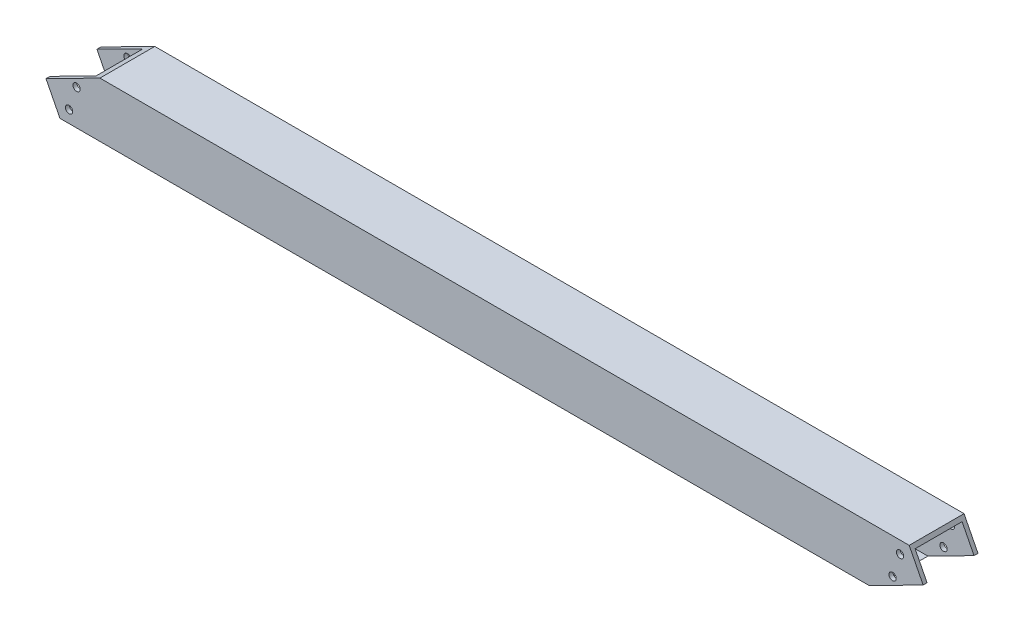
from build123d import *

# Parameters (mm, degrees)
SKETCH1_W          = 50.8
SKETCH1_H          = 50.8
SKETCH1_W_2        = 43.4848
SKETCH1_H_2        = 43.4848
EXTRUDE1_DEPTH     = 3048
SKETCH4_W          = 3318.323681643
SKETCH4_H          = 789.034672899
CUT_EXTRUDE3_DEPTH = 3049.846549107
SKETCH5_R          = 3.37312
CUT_EXTRUDE4_DEPTH = 3049.846549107


with BuildPart() as part:
    # Sketch1 → Extrude1 (new body)
    with BuildSketch(Plane(origin=(0, 0, 0), x_dir=(0, 0, -1), z_dir=(1, 0, 0))):
        with Locations((25.4, 25.4)):
            Rectangle(SKETCH1_W, SKETCH1_H)
        with Locations((25.4, 25.4)):
            Rectangle(SKETCH1_W_2, SKETCH1_H_2, mode=Mode.SUBTRACT)
    extrude(amount=EXTRUDE1_DEPTH)

    # Sketch4 → Cut-Extrude3 (cut, through all)
    with BuildSketch(Plane(origin=(0, 0, -50.8), x_dir=(-1, 0, 0), z_dir=(0, 0, -1))):
        with Locations((-1582.695818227, 39.145992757)):
            Rectangle(SKETCH4_W, SKETCH4_H)
        Polygon((-3048, 25.4), (-2880.991697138, 353.657698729), (-2235.79553067, 25.4), (-2402.803833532, -302.857698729), align=None, mode=Mode.SUBTRACT)
    extrude(amount=-CUT_EXTRUDE3_DEPTH, mode=Mode.SUBTRACT)

    # Sketch5 → Cut-Extrude4 (cut, through all)
    with BuildSketch(Plane.XY):
        with Locations((3026.650308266, 39.473978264)):
            Circle(SKETCH5_R)
        with Locations((3019.699903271, 18.126305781)):
            Circle(SKETCH5_R)
        with Locations((2257.145222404, 11.326021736)):
            Circle(SKETCH5_R)
        with Locations((2264.095627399, 32.673694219)):
            Circle(SKETCH5_R)
    extrude(amount=-CUT_EXTRUDE4_DEPTH, mode=Mode.SUBTRACT)


solid = part.part
